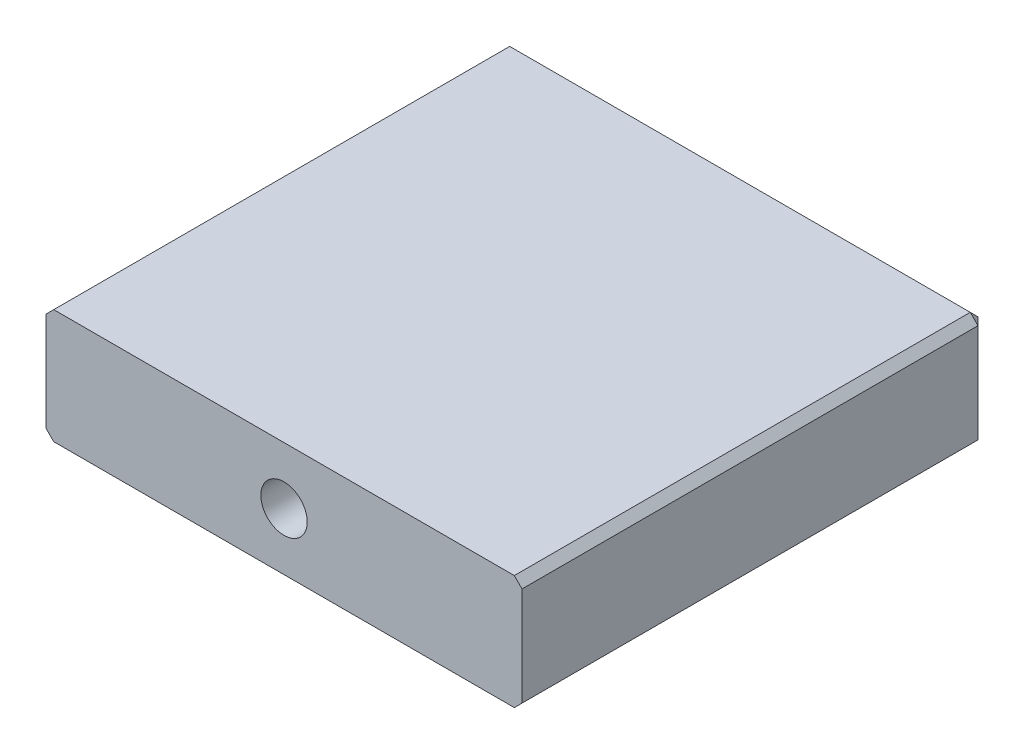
ISO-10303-21;
HEADER;
FILE_DESCRIPTION(('STEP AP214'),'2;1');
FILE_NAME('part.step','',(''),(''),'','','');
FILE_SCHEMA(('AUTOMOTIVE_DESIGN { 1 0 10303 214 1 1 1 1 }'));
ENDSEC;
DATA;
#1=APPLICATION_CONTEXT('core data for automotive mechanical design processes');
#2=APPLICATION_PROTOCOL_DEFINITION('international standard','automotive_design',2000,#1);
#3=PRODUCT_CONTEXT('',#1,'mechanical');
#4=PRODUCT('Part','Part','',(#3));
#5=PRODUCT_RELATED_PRODUCT_CATEGORY('part','',(#4));
#6=PRODUCT_DEFINITION_FORMATION('','',#4);
#7=PRODUCT_DEFINITION_CONTEXT('part definition',#1,'design');
#8=PRODUCT_DEFINITION('design','',#6,#7);
#9=PRODUCT_DEFINITION_SHAPE('','',#8);
#10=(LENGTH_UNIT() NAMED_UNIT(*) SI_UNIT(.MILLI.,.METRE.));
#11=(NAMED_UNIT(*) PLANE_ANGLE_UNIT() SI_UNIT($,.RADIAN.));
#12=(NAMED_UNIT(*) SI_UNIT($,.STERADIAN.) SOLID_ANGLE_UNIT());
#13=UNCERTAINTY_MEASURE_WITH_UNIT(LENGTH_MEASURE(1.E-05),#10,'distance_accuracy_value','');
#14=(GEOMETRIC_REPRESENTATION_CONTEXT(3) GLOBAL_UNCERTAINTY_ASSIGNED_CONTEXT((#13)) GLOBAL_UNIT_ASSIGNED_CONTEXT((#10,
#11,#12)) REPRESENTATION_CONTEXT('',''));
#15=CARTESIAN_POINT('',(0.,0.,0.));
#16=DIRECTION('',(0.,0.,1.));
#17=DIRECTION('',(1.,0.,0.));
#18=AXIS2_PLACEMENT_3D('',#15,#16,#17);
#19=CARTESIAN_POINT('',(0.,0.,15.));
#20=DIRECTION('',(0.,0.,-1.));
#21=DIRECTION('',(-1.,0.,0.));
#22=AXIS2_PLACEMENT_3D('',#19,#20,#21);
#23=PLANE('',#22);
#24=DIRECTION('',(0.,-1.,0.));
#25=VECTOR('',#24,1.);
#26=CARTESIAN_POINT('',(0.,0.,15.));
#27=LINE('',#26,#25);
#28=CARTESIAN_POINT('',(0.,3.45,15.));
#29=VERTEX_POINT('',#28);
#30=CARTESIAN_POINT('',(0.,0.25,15.));
#31=VERTEX_POINT('',#30);
#32=EDGE_CURVE('E128',#29,#31,#27,.T.);
#33=ORIENTED_EDGE('',*,*,#32,.T.);
#34=DIRECTION('',(-0.707106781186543,0.707106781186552,0.));
#35=VECTOR('',#34,1.);
#36=CARTESIAN_POINT('',(0.249999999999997,0.,15.));
#37=LINE('',#36,#35);
#38=CARTESIAN_POINT('',(0.249999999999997,0.,15.));
#39=VERTEX_POINT('',#38);
#40=EDGE_CURVE('E122',#31,#39,#37,.F.);
#41=ORIENTED_EDGE('',*,*,#40,.T.);
#42=DIRECTION('',(1.,0.,0.));
#43=VECTOR('',#42,1.);
#44=CARTESIAN_POINT('',(0.,0.,15.));
#45=LINE('',#44,#43);
#46=CARTESIAN_POINT('',(15.15,0.,15.));
#47=VERTEX_POINT('',#46);
#48=EDGE_CURVE('E125',#39,#47,#45,.T.);
#49=ORIENTED_EDGE('',*,*,#48,.T.);
#50=DIRECTION('',(-0.707106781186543,-0.707106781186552,0.));
#51=VECTOR('',#50,1.);
#52=CARTESIAN_POINT('',(15.4,0.25,15.));
#53=LINE('',#52,#51);
#54=CARTESIAN_POINT('',(15.4,0.25,15.));
#55=VERTEX_POINT('',#54);
#56=EDGE_CURVE('E160',#47,#55,#53,.F.);
#57=ORIENTED_EDGE('',*,*,#56,.T.);
#58=DIRECTION('',(0.,1.,0.));
#59=VECTOR('',#58,1.);
#60=CARTESIAN_POINT('',(15.4,0.,15.));
#61=LINE('',#60,#59);
#62=CARTESIAN_POINT('',(15.4,3.45,15.));
#63=VERTEX_POINT('',#62);
#64=EDGE_CURVE('E141',#55,#63,#61,.T.);
#65=ORIENTED_EDGE('',*,*,#64,.T.);
#66=DIRECTION('',(0.707106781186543,-0.707106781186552,0.));
#67=VECTOR('',#66,1.);
#68=CARTESIAN_POINT('',(15.15,3.7,15.));
#69=LINE('',#68,#67);
#70=CARTESIAN_POINT('',(15.15,3.7,15.));
#71=VERTEX_POINT('',#70);
#72=EDGE_CURVE('E158',#63,#71,#69,.F.);
#73=ORIENTED_EDGE('',*,*,#72,.T.);
#74=DIRECTION('',(-1.,0.,0.));
#75=VECTOR('',#74,1.);
#76=CARTESIAN_POINT('',(0.,3.7,15.));
#77=LINE('',#76,#75);
#78=CARTESIAN_POINT('',(0.249999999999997,3.7,15.));
#79=VERTEX_POINT('',#78);
#80=EDGE_CURVE('E226',#71,#79,#77,.T.);
#81=ORIENTED_EDGE('',*,*,#80,.T.);
#82=DIRECTION('',(0.707106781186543,0.707106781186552,0.));
#83=VECTOR('',#82,1.);
#84=CARTESIAN_POINT('',(0.,3.45,15.));
#85=LINE('',#84,#83);
#86=EDGE_CURVE('E133',#79,#29,#85,.F.);
#87=ORIENTED_EDGE('',*,*,#86,.T.);
#88=EDGE_LOOP('',(#33,#41,#49,#57,#65,#73,#81,#87));
#89=FACE_BOUND('',#88,.T.);
#90=CARTESIAN_POINT('',(7.7,1.85,15.));
#91=DIRECTION('',(0.,0.,1.));
#92=DIRECTION('',(1.,0.,0.));
#93=AXIS2_PLACEMENT_3D('',#90,#91,#92);
#94=CIRCLE('',#93,0.75);
#95=CARTESIAN_POINT('',(8.45,1.85,15.));
#96=VERTEX_POINT('',#95);
#97=EDGE_CURVE('E216',#96,#96,#94,.T.);
#98=ORIENTED_EDGE('',*,*,#97,.F.);
#99=EDGE_LOOP('',(#98));
#100=FACE_BOUND('',#99,.T.);
#101=ADVANCED_FACE('F46',(#89,#100),#23,.F.);
#102=CARTESIAN_POINT('',(0.,0.,0.));
#103=DIRECTION('',(0.,0.,-1.));
#104=DIRECTION('',(-1.,0.,0.));
#105=AXIS2_PLACEMENT_3D('',#102,#103,#104);
#106=PLANE('',#105);
#107=DIRECTION('',(0.,-1.,0.));
#108=VECTOR('',#107,1.);
#109=CARTESIAN_POINT('',(15.15,0.,0.));
#110=LINE('',#109,#108);
#111=CARTESIAN_POINT('',(15.15,3.45,0.));
#112=VERTEX_POINT('',#111);
#113=CARTESIAN_POINT('',(15.15,0.25,0.));
#114=VERTEX_POINT('',#113);
#115=EDGE_CURVE('E132',#112,#114,#110,.T.);
#116=ORIENTED_EDGE('',*,*,#115,.T.);
#117=DIRECTION('',(-1.,0.,0.));
#118=VECTOR('',#117,1.);
#119=CARTESIAN_POINT('',(0.,0.25,0.));
#120=LINE('',#119,#118);
#121=CARTESIAN_POINT('',(0.25,0.25,0.));
#122=VERTEX_POINT('',#121);
#123=EDGE_CURVE('E168',#114,#122,#120,.T.);
#124=ORIENTED_EDGE('',*,*,#123,.T.);
#125=DIRECTION('',(0.,1.,0.));
#126=VECTOR('',#125,1.);
#127=CARTESIAN_POINT('',(0.25,3.7,0.));
#128=LINE('',#127,#126);
#129=CARTESIAN_POINT('',(0.25,3.45,0.));
#130=VERTEX_POINT('',#129);
#131=EDGE_CURVE('E166',#122,#130,#128,.T.);
#132=ORIENTED_EDGE('',*,*,#131,.T.);
#133=DIRECTION('',(1.,0.,0.));
#134=VECTOR('',#133,1.);
#135=CARTESIAN_POINT('',(15.4,3.45,0.));
#136=LINE('',#135,#134);
#137=EDGE_CURVE('E164',#130,#112,#136,.T.);
#138=ORIENTED_EDGE('',*,*,#137,.T.);
#139=EDGE_LOOP('',(#116,#124,#132,#138));
#140=FACE_BOUND('',#139,.T.);
#141=CARTESIAN_POINT('',(7.7,1.85,0.));
#142=DIRECTION('',(0.,0.,1.));
#143=DIRECTION('',(1.,0.,0.));
#144=AXIS2_PLACEMENT_3D('',#141,#142,#143);
#145=CIRCLE('',#144,0.75);
#146=CARTESIAN_POINT('',(8.45,1.85,0.));
#147=VERTEX_POINT('',#146);
#148=EDGE_CURVE('E211',#147,#147,#145,.T.);
#149=ORIENTED_EDGE('',*,*,#148,.T.);
#150=EDGE_LOOP('',(#149));
#151=FACE_BOUND('',#150,.T.);
#152=ADVANCED_FACE('F261',(#140,#151),#106,.T.);
#153=CARTESIAN_POINT('',(0.,0.,15.));
#154=DIRECTION('',(1.,0.,0.));
#155=DIRECTION('',(0.,0.,-1.));
#156=AXIS2_PLACEMENT_3D('',#153,#154,#155);
#157=PLANE('',#156);
#158=DIRECTION('',(0.,-1.,0.));
#159=VECTOR('',#158,1.);
#160=CARTESIAN_POINT('',(0.,0.,0.249999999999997));
#161=LINE('',#160,#159);
#162=CARTESIAN_POINT('',(0.,3.45,0.249999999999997));
#163=VERTEX_POINT('',#162);
#164=CARTESIAN_POINT('',(0.,0.25,0.249999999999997));
#165=VERTEX_POINT('',#164);
#166=EDGE_CURVE('E150',#163,#165,#161,.T.);
#167=ORIENTED_EDGE('',*,*,#166,.T.);
#168=DIRECTION('',(0.,0.,1.));
#169=VECTOR('',#168,1.);
#170=CARTESIAN_POINT('',(0.,0.25,15.));
#171=LINE('',#170,#169);
#172=EDGE_CURVE('E156',#165,#31,#171,.T.);
#173=ORIENTED_EDGE('',*,*,#172,.T.);
#174=ORIENTED_EDGE('',*,*,#32,.F.);
#175=DIRECTION('',(0.,0.,-1.));
#176=VECTOR('',#175,1.);
#177=CARTESIAN_POINT('',(0.,3.45,15.));
#178=LINE('',#177,#176);
#179=EDGE_CURVE('E147',#29,#163,#178,.T.);
#180=ORIENTED_EDGE('',*,*,#179,.T.);
#181=EDGE_LOOP('',(#167,#173,#174,#180));
#182=FACE_BOUND('',#181,.T.);
#183=ADVANCED_FACE('F241',(#182),#157,.F.);
#184=CARTESIAN_POINT('',(0.,0.,15.));
#185=DIRECTION('',(0.,1.,0.));
#186=DIRECTION('',(0.,0.,1.));
#187=AXIS2_PLACEMENT_3D('',#184,#185,#186);
#188=PLANE('',#187);
#189=ORIENTED_EDGE('',*,*,#48,.F.);
#190=DIRECTION('',(0.,0.,-1.));
#191=VECTOR('',#190,1.);
#192=CARTESIAN_POINT('',(0.249999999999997,0.,15.));
#193=LINE('',#192,#191);
#194=CARTESIAN_POINT('',(0.249999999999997,0.,0.249999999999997));
#195=VERTEX_POINT('',#194);
#196=EDGE_CURVE('E138',#39,#195,#193,.T.);
#197=ORIENTED_EDGE('',*,*,#196,.T.);
#198=DIRECTION('',(1.,0.,0.));
#199=VECTOR('',#198,1.);
#200=CARTESIAN_POINT('',(15.4,0.,0.249999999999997));
#201=LINE('',#200,#199);
#202=CARTESIAN_POINT('',(15.15,0.,0.249999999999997));
#203=VERTEX_POINT('',#202);
#204=EDGE_CURVE('E148',#195,#203,#201,.T.);
#205=ORIENTED_EDGE('',*,*,#204,.T.);
#206=DIRECTION('',(0.,0.,1.));
#207=VECTOR('',#206,1.);
#208=CARTESIAN_POINT('',(15.15,0.,15.));
#209=LINE('',#208,#207);
#210=EDGE_CURVE('E140',#203,#47,#209,.T.);
#211=ORIENTED_EDGE('',*,*,#210,.T.);
#212=EDGE_LOOP('',(#189,#197,#205,#211));
#213=FACE_BOUND('',#212,.T.);
#214=ADVANCED_FACE('F137',(#213),#188,.F.);
#215=CARTESIAN_POINT('',(15.4,0.,15.));
#216=DIRECTION('',(-1.,0.,0.));
#217=DIRECTION('',(0.,0.,1.));
#218=AXIS2_PLACEMENT_3D('',#215,#216,#217);
#219=PLANE('',#218);
#220=ORIENTED_EDGE('',*,*,#64,.F.);
#221=DIRECTION('',(0.,0.,-1.));
#222=VECTOR('',#221,1.);
#223=CARTESIAN_POINT('',(15.4,0.25,15.));
#224=LINE('',#223,#222);
#225=CARTESIAN_POINT('',(15.4,0.25,0.25));
#226=VERTEX_POINT('',#225);
#227=EDGE_CURVE('E13',#55,#226,#224,.T.);
#228=ORIENTED_EDGE('',*,*,#227,.T.);
#229=DIRECTION('',(0.,1.,0.));
#230=VECTOR('',#229,1.);
#231=CARTESIAN_POINT('',(15.4,3.7,0.25));
#232=LINE('',#231,#230);
#233=CARTESIAN_POINT('',(15.4,3.45,0.25));
#234=VERTEX_POINT('',#233);
#235=EDGE_CURVE('E55',#226,#234,#232,.T.);
#236=ORIENTED_EDGE('',*,*,#235,.T.);
#237=DIRECTION('',(0.,0.,1.));
#238=VECTOR('',#237,1.);
#239=CARTESIAN_POINT('',(15.4,3.45,15.));
#240=LINE('',#239,#238);
#241=EDGE_CURVE('E177',#234,#63,#240,.T.);
#242=ORIENTED_EDGE('',*,*,#241,.T.);
#243=EDGE_LOOP('',(#220,#228,#236,#242));
#244=FACE_BOUND('',#243,.T.);
#245=ADVANCED_FACE('F286',(#244),#219,.F.);
#246=CARTESIAN_POINT('',(0.,3.7,15.));
#247=DIRECTION('',(0.,-1.,0.));
#248=DIRECTION('',(0.,0.,-1.));
#249=AXIS2_PLACEMENT_3D('',#246,#247,#248);
#250=PLANE('',#249);
#251=DIRECTION('',(-1.,0.,0.));
#252=VECTOR('',#251,1.);
#253=CARTESIAN_POINT('',(0.,3.7,0.249999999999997));
#254=LINE('',#253,#252);
#255=CARTESIAN_POINT('',(15.15,3.7,0.249999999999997));
#256=VERTEX_POINT('',#255);
#257=CARTESIAN_POINT('',(0.249999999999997,3.7,0.249999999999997));
#258=VERTEX_POINT('',#257);
#259=EDGE_CURVE('E173',#256,#258,#254,.T.);
#260=ORIENTED_EDGE('',*,*,#259,.T.);
#261=DIRECTION('',(0.,0.,1.));
#262=VECTOR('',#261,1.);
#263=CARTESIAN_POINT('',(0.249999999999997,3.7,15.));
#264=LINE('',#263,#262);
#265=EDGE_CURVE('E175',#258,#79,#264,.T.);
#266=ORIENTED_EDGE('',*,*,#265,.T.);
#267=ORIENTED_EDGE('',*,*,#80,.F.);
#268=DIRECTION('',(0.,0.,-1.));
#269=VECTOR('',#268,1.);
#270=CARTESIAN_POINT('',(15.15,3.7,15.));
#271=LINE('',#270,#269);
#272=EDGE_CURVE('E171',#71,#256,#271,.T.);
#273=ORIENTED_EDGE('',*,*,#272,.T.);
#274=EDGE_LOOP('',(#260,#266,#267,#273));
#275=FACE_BOUND('',#274,.T.);
#276=ADVANCED_FACE('F283',(#275),#250,.F.);
#277=CARTESIAN_POINT('',(7.7,1.85,15.));
#278=DIRECTION('',(0.,0.,-1.));
#279=DIRECTION('',(-1.,0.,0.));
#280=AXIS2_PLACEMENT_3D('',#277,#278,#279);
#281=CYLINDRICAL_SURFACE('',#280,0.75);
#282=ORIENTED_EDGE('',*,*,#97,.T.);
#283=EDGE_LOOP('',(#282));
#284=FACE_BOUND('',#283,.T.);
#285=ORIENTED_EDGE('',*,*,#148,.F.);
#286=EDGE_LOOP('',(#285));
#287=FACE_BOUND('',#286,.T.);
#288=ADVANCED_FACE('F273',(#284,#287),#281,.F.);
#289=CARTESIAN_POINT('',(15.15,3.7,15.));
#290=DIRECTION('',(-0.707106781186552,-0.707106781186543,0.));
#291=DIRECTION('',(0.,0.,-1.));
#292=AXIS2_PLACEMENT_3D('',#289,#290,#291);
#293=PLANE('',#292);
#294=DIRECTION('',(-0.707106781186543,0.707106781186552,0.));
#295=VECTOR('',#294,1.);
#296=CARTESIAN_POINT('',(15.275,3.575,0.249999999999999));
#297=LINE('',#296,#295);
#298=EDGE_CURVE('E50',#256,#234,#297,.F.);
#299=ORIENTED_EDGE('',*,*,#298,.F.);
#300=ORIENTED_EDGE('',*,*,#272,.F.);
#301=ORIENTED_EDGE('',*,*,#72,.F.);
#302=ORIENTED_EDGE('',*,*,#241,.F.);
#303=EDGE_LOOP('',(#299,#300,#301,#302));
#304=FACE_BOUND('',#303,.T.);
#305=ADVANCED_FACE('F48',(#304),#293,.F.);
#306=CARTESIAN_POINT('',(15.15,3.45,0.));
#307=DIRECTION('',(0.577350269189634,0.577350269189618,-0.577350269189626));
#308=DIRECTION('',(-0.707106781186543,0.,-0.707106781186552));
#309=AXIS2_PLACEMENT_3D('',#306,#307,#308);
#310=PLANE('',#309);
#311=DIRECTION('',(0.,0.707106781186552,0.707106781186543));
#312=VECTOR('',#311,1.);
#313=CARTESIAN_POINT('',(15.15,3.45,0.));
#314=LINE('',#313,#312);
#315=EDGE_CURVE('E203',#256,#112,#314,.F.);
#316=ORIENTED_EDGE('',*,*,#315,.F.);
#317=ORIENTED_EDGE('',*,*,#298,.T.);
#318=DIRECTION('',(-0.707106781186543,0.,-0.707106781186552));
#319=VECTOR('',#318,1.);
#320=CARTESIAN_POINT('',(15.15,3.45,0.));
#321=LINE('',#320,#319);
#322=EDGE_CURVE('E205',#112,#234,#321,.F.);
#323=ORIENTED_EDGE('',*,*,#322,.F.);
#324=EDGE_LOOP('',(#316,#317,#323));
#325=FACE_BOUND('',#324,.T.);
#326=ADVANCED_FACE('F266',(#325),#310,.T.);
#327=CARTESIAN_POINT('',(15.4,0.25,15.));
#328=DIRECTION('',(-0.707106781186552,0.707106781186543,0.));
#329=DIRECTION('',(0.,0.,-1.));
#330=AXIS2_PLACEMENT_3D('',#327,#328,#329);
#331=PLANE('',#330);
#332=ORIENTED_EDGE('',*,*,#56,.F.);
#333=ORIENTED_EDGE('',*,*,#210,.F.);
#334=DIRECTION('',(0.707106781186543,0.707106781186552,0.));
#335=VECTOR('',#334,1.);
#336=CARTESIAN_POINT('',(15.15,0.,0.249999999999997));
#337=LINE('',#336,#335);
#338=EDGE_CURVE('E200',#226,#203,#337,.F.);
#339=ORIENTED_EDGE('',*,*,#338,.F.);
#340=ORIENTED_EDGE('',*,*,#227,.F.);
#341=EDGE_LOOP('',(#332,#333,#339,#340));
#342=FACE_BOUND('',#341,.T.);
#343=ADVANCED_FACE('F255',(#342),#331,.F.);
#344=CARTESIAN_POINT('',(15.4,0.,0.25));
#345=DIRECTION('',(0.707106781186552,0.,-0.707106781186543));
#346=DIRECTION('',(0.,-1.,0.));
#347=AXIS2_PLACEMENT_3D('',#344,#345,#346);
#348=PLANE('',#347);
#349=ORIENTED_EDGE('',*,*,#322,.T.);
#350=ORIENTED_EDGE('',*,*,#235,.F.);
#351=DIRECTION('',(0.707106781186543,0.,0.707106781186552));
#352=VECTOR('',#351,1.);
#353=CARTESIAN_POINT('',(15.275,0.25,0.125));
#354=LINE('',#353,#352);
#355=EDGE_CURVE('E197',#114,#226,#354,.T.);
#356=ORIENTED_EDGE('',*,*,#355,.F.);
#357=ORIENTED_EDGE('',*,*,#115,.F.);
#358=EDGE_LOOP('',(#349,#350,#356,#357));
#359=FACE_BOUND('',#358,.T.);
#360=ADVANCED_FACE('F259',(#359),#348,.T.);
#361=CARTESIAN_POINT('',(0.,3.7,0.249999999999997));
#362=DIRECTION('',(0.,0.707106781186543,-0.707106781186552));
#363=DIRECTION('',(1.,0.,0.));
#364=AXIS2_PLACEMENT_3D('',#361,#362,#363);
#365=PLANE('',#364);
#366=ORIENTED_EDGE('',*,*,#315,.T.);
#367=ORIENTED_EDGE('',*,*,#137,.F.);
#368=DIRECTION('',(0.,-0.707106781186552,-0.707106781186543));
#369=VECTOR('',#368,1.);
#370=CARTESIAN_POINT('',(0.25,3.45,0.));
#371=LINE('',#370,#369);
#372=EDGE_CURVE('E194',#258,#130,#371,.T.);
#373=ORIENTED_EDGE('',*,*,#372,.F.);
#374=ORIENTED_EDGE('',*,*,#259,.F.);
#375=EDGE_LOOP('',(#366,#367,#373,#374));
#376=FACE_BOUND('',#375,.T.);
#377=ADVANCED_FACE('F265',(#376),#365,.T.);
#378=CARTESIAN_POINT('',(0.,3.45,15.));
#379=DIRECTION('',(0.707106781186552,-0.707106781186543,0.));
#380=DIRECTION('',(0.,0.,-1.));
#381=AXIS2_PLACEMENT_3D('',#378,#379,#380);
#382=PLANE('',#381);
#383=ORIENTED_EDGE('',*,*,#86,.F.);
#384=ORIENTED_EDGE('',*,*,#265,.F.);
#385=DIRECTION('',(-0.707106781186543,-0.707106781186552,0.));
#386=VECTOR('',#385,1.);
#387=CARTESIAN_POINT('',(0.124999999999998,3.575,0.249999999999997));
#388=LINE('',#387,#386);
#389=EDGE_CURVE('E191',#163,#258,#388,.F.);
#390=ORIENTED_EDGE('',*,*,#389,.F.);
#391=ORIENTED_EDGE('',*,*,#179,.F.);
#392=EDGE_LOOP('',(#383,#384,#390,#391));
#393=FACE_BOUND('',#392,.T.);
#394=ADVANCED_FACE('F236',(#393),#382,.F.);
#395=CARTESIAN_POINT('',(15.15,0.,0.249999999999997));
#396=DIRECTION('',(0.577350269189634,-0.577350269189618,-0.577350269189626));
#397=DIRECTION('',(-0.707106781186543,0.,-0.707106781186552));
#398=AXIS2_PLACEMENT_3D('',#395,#396,#397);
#399=PLANE('',#398);
#400=ORIENTED_EDGE('',*,*,#355,.T.);
#401=ORIENTED_EDGE('',*,*,#338,.T.);
#402=DIRECTION('',(0.,0.707106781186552,-0.707106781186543));
#403=VECTOR('',#402,1.);
#404=CARTESIAN_POINT('',(15.15,0.,0.249999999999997));
#405=LINE('',#404,#403);
#406=EDGE_CURVE('E188',#114,#203,#405,.F.);
#407=ORIENTED_EDGE('',*,*,#406,.F.);
#408=EDGE_LOOP('',(#400,#401,#407));
#409=FACE_BOUND('',#408,.T.);
#410=ADVANCED_FACE('F257',(#409),#399,.T.);
#411=CARTESIAN_POINT('',(0.25,3.45,0.));
#412=DIRECTION('',(-0.577350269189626,0.577350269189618,-0.577350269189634));
#413=DIRECTION('',(-0.707106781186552,0.,0.707106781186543));
#414=AXIS2_PLACEMENT_3D('',#411,#412,#413);
#415=PLANE('',#414);
#416=ORIENTED_EDGE('',*,*,#389,.T.);
#417=ORIENTED_EDGE('',*,*,#372,.T.);
#418=DIRECTION('',(-0.707106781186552,0.,0.707106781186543));
#419=VECTOR('',#418,1.);
#420=CARTESIAN_POINT('',(0.25,3.45,0.));
#421=LINE('',#420,#419);
#422=EDGE_CURVE('E185',#163,#130,#421,.F.);
#423=ORIENTED_EDGE('',*,*,#422,.F.);
#424=EDGE_LOOP('',(#416,#417,#423));
#425=FACE_BOUND('',#424,.T.);
#426=ADVANCED_FACE('F303',(#425),#415,.T.);
#427=CARTESIAN_POINT('',(0.,0.,0.249999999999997));
#428=DIRECTION('',(0.,-0.707106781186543,-0.707106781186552));
#429=DIRECTION('',(-1.,0.,0.));
#430=AXIS2_PLACEMENT_3D('',#427,#428,#429);
#431=PLANE('',#430);
#432=ORIENTED_EDGE('',*,*,#406,.T.);
#433=ORIENTED_EDGE('',*,*,#204,.F.);
#434=DIRECTION('',(0.,-0.707106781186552,0.707106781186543));
#435=VECTOR('',#434,1.);
#436=CARTESIAN_POINT('',(0.249999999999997,0.,0.249999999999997));
#437=LINE('',#436,#435);
#438=EDGE_CURVE('E183',#122,#195,#437,.T.);
#439=ORIENTED_EDGE('',*,*,#438,.F.);
#440=ORIENTED_EDGE('',*,*,#123,.F.);
#441=EDGE_LOOP('',(#432,#433,#439,#440));
#442=FACE_BOUND('',#441,.T.);
#443=ADVANCED_FACE('F251',(#442),#431,.T.);
#444=CARTESIAN_POINT('',(0.,0.,0.249999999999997));
#445=DIRECTION('',(-0.707106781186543,0.,-0.707106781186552));
#446=DIRECTION('',(0.,1.,0.));
#447=AXIS2_PLACEMENT_3D('',#444,#445,#446);
#448=PLANE('',#447);
#449=ORIENTED_EDGE('',*,*,#422,.T.);
#450=ORIENTED_EDGE('',*,*,#131,.F.);
#451=DIRECTION('',(0.707106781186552,0.,-0.707106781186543));
#452=VECTOR('',#451,1.);
#453=CARTESIAN_POINT('',(0.125,0.25,0.124999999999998));
#454=LINE('',#453,#452);
#455=EDGE_CURVE('E181',#165,#122,#454,.T.);
#456=ORIENTED_EDGE('',*,*,#455,.F.);
#457=ORIENTED_EDGE('',*,*,#166,.F.);
#458=EDGE_LOOP('',(#449,#450,#456,#457));
#459=FACE_BOUND('',#458,.T.);
#460=ADVANCED_FACE('F297',(#459),#448,.T.);
#461=CARTESIAN_POINT('',(0.249999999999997,0.,0.249999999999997));
#462=DIRECTION('',(-0.577350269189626,-0.577350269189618,-0.577350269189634));
#463=DIRECTION('',(-0.707106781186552,0.,0.707106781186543));
#464=AXIS2_PLACEMENT_3D('',#461,#462,#463);
#465=PLANE('',#464);
#466=ORIENTED_EDGE('',*,*,#455,.T.);
#467=ORIENTED_EDGE('',*,*,#438,.T.);
#468=DIRECTION('',(0.707106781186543,-0.707106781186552,0.));
#469=VECTOR('',#468,1.);
#470=CARTESIAN_POINT('',(0.249999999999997,0.,0.249999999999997));
#471=LINE('',#470,#469);
#472=EDGE_CURVE('E145',#165,#195,#471,.T.);
#473=ORIENTED_EDGE('',*,*,#472,.F.);
#474=EDGE_LOOP('',(#466,#467,#473));
#475=FACE_BOUND('',#474,.T.);
#476=ADVANCED_FACE('F245',(#475),#465,.T.);
#477=CARTESIAN_POINT('',(0.249999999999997,0.,15.));
#478=DIRECTION('',(0.707106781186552,0.707106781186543,0.));
#479=DIRECTION('',(0.,0.,-1.));
#480=AXIS2_PLACEMENT_3D('',#477,#478,#479);
#481=PLANE('',#480);
#482=ORIENTED_EDGE('',*,*,#40,.F.);
#483=ORIENTED_EDGE('',*,*,#172,.F.);
#484=ORIENTED_EDGE('',*,*,#472,.T.);
#485=ORIENTED_EDGE('',*,*,#196,.F.);
#486=EDGE_LOOP('',(#482,#483,#484,#485));
#487=FACE_BOUND('',#486,.T.);
#488=ADVANCED_FACE('F143',(#487),#481,.F.);
#489=CLOSED_SHELL('',(#101,#152,#183,#214,#245,#276,#288,#305,#326,#343,#360,#377,#394,#410,
#426,#443,#460,#476,#488));
#490=MANIFOLD_SOLID_BREP('B2',#489);
#491=ADVANCED_BREP_SHAPE_REPRESENTATION('',(#18,#490),#14);
#492=SHAPE_DEFINITION_REPRESENTATION(#9,#491);
ENDSEC;
END-ISO-10303-21;
